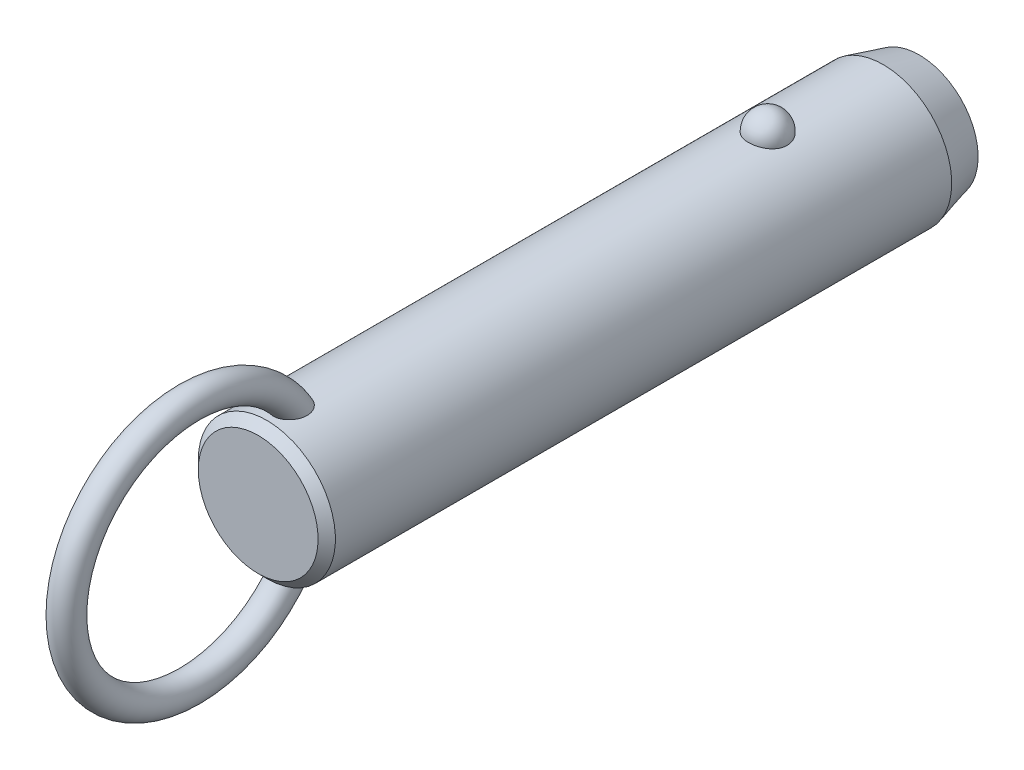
ISO-10303-21;
HEADER;
FILE_DESCRIPTION(('STEP AP214'),'2;1');
FILE_NAME('part.step','',(''),(''),'','','');
FILE_SCHEMA(('AUTOMOTIVE_DESIGN { 1 0 10303 214 1 1 1 1 }'));
ENDSEC;
DATA;
#1=APPLICATION_CONTEXT('core data for automotive mechanical design processes');
#2=APPLICATION_PROTOCOL_DEFINITION('international standard','automotive_design',2000,#1);
#3=PRODUCT_CONTEXT('',#1,'mechanical');
#4=PRODUCT('Part','Part','',(#3));
#5=PRODUCT_RELATED_PRODUCT_CATEGORY('part','',(#4));
#6=PRODUCT_DEFINITION_FORMATION('','',#4);
#7=PRODUCT_DEFINITION_CONTEXT('part definition',#1,'design');
#8=PRODUCT_DEFINITION('design','',#6,#7);
#9=PRODUCT_DEFINITION_SHAPE('','',#8);
#10=(LENGTH_UNIT() NAMED_UNIT(*) SI_UNIT(.MILLI.,.METRE.));
#11=(NAMED_UNIT(*) PLANE_ANGLE_UNIT() SI_UNIT($,.RADIAN.));
#12=(NAMED_UNIT(*) SI_UNIT($,.STERADIAN.) SOLID_ANGLE_UNIT());
#13=UNCERTAINTY_MEASURE_WITH_UNIT(LENGTH_MEASURE(1.E-05),#10,'distance_accuracy_value','');
#14=(GEOMETRIC_REPRESENTATION_CONTEXT(3) GLOBAL_UNCERTAINTY_ASSIGNED_CONTEXT((#13)) GLOBAL_UNIT_ASSIGNED_CONTEXT((#10,
#11,#12)) REPRESENTATION_CONTEXT('',''));
#15=CARTESIAN_POINT('',(0.,0.,0.));
#16=DIRECTION('',(0.,0.,1.));
#17=DIRECTION('',(1.,0.,0.));
#18=AXIS2_PLACEMENT_3D('',#15,#16,#17);
#19=CARTESIAN_POINT('',(0.,0.,58.4));
#20=DIRECTION('',(0.,0.,-1.));
#21=DIRECTION('',(-1.,0.,0.));
#22=AXIS2_PLACEMENT_3D('',#19,#20,#21);
#23=CYLINDRICAL_SURFACE('',#22,9.5);
#24=CARTESIAN_POINT('',(2.67259918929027,9.11631578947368,-2.70000000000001));
#25=CARTESIAN_POINT('',(2.6725968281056,9.11631786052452,-2.54909854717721));
#26=CARTESIAN_POINT('',(2.66030567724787,9.11994722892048,-2.39816735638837));
#27=CARTESIAN_POINT('',(2.6114347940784,9.13405924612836,-2.10058568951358));
#28=CARTESIAN_POINT('',(2.57484658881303,9.14454428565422,-1.95393672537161));
#29=CARTESIAN_POINT('',(2.47830875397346,9.17117631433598,-1.66916069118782));
#30=CARTESIAN_POINT('',(2.41836936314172,9.18732082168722,-1.53102991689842));
#31=CARTESIAN_POINT('',(2.27661331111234,9.22346780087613,-1.26705393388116));
#32=CARTESIAN_POINT('',(2.19479699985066,9.24347021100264,-1.14120852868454));
#33=CARTESIAN_POINT('',(2.01085282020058,9.28522401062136,-0.904632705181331));
#34=CARTESIAN_POINT('',(1.90862396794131,9.30698376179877,-0.793982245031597));
#35=CARTESIAN_POINT('',(1.6867437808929,9.34973971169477,-0.591607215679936));
#36=CARTESIAN_POINT('',(1.56709244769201,9.37073591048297,-0.499882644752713));
#37=CARTESIAN_POINT('',(1.31393976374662,9.40956370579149,-0.338167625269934));
#38=CARTESIAN_POINT('',(1.18048026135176,9.42740444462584,-0.268113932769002));
#39=CARTESIAN_POINT('',(0.903154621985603,9.45799906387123,-0.151390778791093));
#40=CARTESIAN_POINT('',(0.759289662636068,9.47075351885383,-0.104718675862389));
#41=CARTESIAN_POINT('',(0.468074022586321,9.48956256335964,-0.0367633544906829));
#42=CARTESIAN_POINT('',(0.320836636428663,9.49573643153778,-0.0150275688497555));
#43=CARTESIAN_POINT('',(0.0246714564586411,9.50112183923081,0.00396199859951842));
#44=CARTESIAN_POINT('',(-0.124256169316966,9.50033406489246,0.00121819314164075));
#45=CARTESIAN_POINT('',(-0.417264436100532,9.4919475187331,-0.0284441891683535));
#46=CARTESIAN_POINT('',(-0.56138413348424,9.48444885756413,-0.0550074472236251));
#47=CARTESIAN_POINT('',(-0.842986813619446,9.46357853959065,-0.131064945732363));
#48=CARTESIAN_POINT('',(-0.980469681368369,9.450206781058,-0.180559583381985));
#49=CARTESIAN_POINT('',(-1.24585005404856,9.41890822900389,-0.301476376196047));
#50=CARTESIAN_POINT('',(-1.37368611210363,9.40095498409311,-0.373026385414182));
#51=CARTESIAN_POINT('',(-1.61552738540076,9.36242964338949,-0.536025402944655));
#52=CARTESIAN_POINT('',(-1.72953116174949,9.34185727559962,-0.627476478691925));
#53=CARTESIAN_POINT('',(-1.9429225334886,9.29984568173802,-0.829844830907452));
#54=CARTESIAN_POINT('',(-2.04198021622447,9.27839736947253,-0.94110821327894));
#55=CARTESIAN_POINT('',(-2.22026460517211,9.23735994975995,-1.17883414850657));
#56=CARTESIAN_POINT('',(-2.29948985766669,9.21777097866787,-1.30529781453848));
#57=CARTESIAN_POINT('',(-2.43697287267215,9.18238994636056,-1.57158566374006));
#58=CARTESIAN_POINT('',(-2.49497068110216,9.16664569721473,-1.71155057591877));
#59=CARTESIAN_POINT('',(-2.5872073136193,9.14104303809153,-1.99961197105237));
#60=CARTESIAN_POINT('',(-2.62144683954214,9.13118445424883,-2.14770821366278));
#61=CARTESIAN_POINT('',(-2.66521466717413,9.11850622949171,-2.44715424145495));
#62=CARTESIAN_POINT('',(-2.67484831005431,9.11565658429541,-2.59848735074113));
#63=CARTESIAN_POINT('',(-2.66946735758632,9.11723375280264,-2.90067317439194));
#64=CARTESIAN_POINT('',(-2.65445345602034,9.12166036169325,-3.05152590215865));
#65=CARTESIAN_POINT('',(-2.60029711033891,9.13724422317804,-3.34766110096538));
#66=CARTESIAN_POINT('',(-2.56127978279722,9.14836656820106,-3.49296833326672));
#67=CARTESIAN_POINT('',(-2.46018844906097,9.17606676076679,-3.77477535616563));
#68=CARTESIAN_POINT('',(-2.39811349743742,9.1926448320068,-3.9112747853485));
#69=CARTESIAN_POINT('',(-2.25202303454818,9.22952198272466,-4.17244273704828));
#70=CARTESIAN_POINT('',(-2.16788714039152,9.24984129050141,-4.29704106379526));
#71=CARTESIAN_POINT('',(-1.9799408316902,9.29188255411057,-4.53013066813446));
#72=CARTESIAN_POINT('',(-1.87612963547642,9.31360456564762,-4.63862130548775));
#73=CARTESIAN_POINT('',(-1.65105429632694,9.35612959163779,-4.8369029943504));
#74=CARTESIAN_POINT('',(-1.52972405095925,9.37692871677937,-4.92661991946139));
#75=CARTESIAN_POINT('',(-1.27318250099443,9.41518970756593,-5.08429106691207));
#76=CARTESIAN_POINT('',(-1.13797219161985,9.432651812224,-5.15224684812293));
#77=CARTESIAN_POINT('',(-0.859280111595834,9.46208255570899,-5.26371827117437));
#78=CARTESIAN_POINT('',(-0.715925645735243,9.47411833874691,-5.30753421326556));
#79=CARTESIAN_POINT('',(-0.423550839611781,9.4916822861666,-5.37076321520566));
#80=CARTESIAN_POINT('',(-0.2745312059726,9.49721125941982,-5.39017930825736));
#81=CARTESIAN_POINT('',(0.0218446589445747,9.50110860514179,-5.40390587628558));
#82=CARTESIAN_POINT('',(0.16917707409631,9.49961381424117,-5.39869609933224));
#83=CARTESIAN_POINT('',(0.460808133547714,9.48993906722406,-5.36441955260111));
#84=CARTESIAN_POINT('',(0.605106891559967,9.48175936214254,-5.33535367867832));
#85=CARTESIAN_POINT('',(0.886027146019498,9.4596376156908,-5.25435587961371));
#86=CARTESIAN_POINT('',(1.02267710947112,9.44571881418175,-5.20251612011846));
#87=CARTESIAN_POINT('',(1.28523827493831,9.41358993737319,-5.07741549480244));
#88=CARTESIAN_POINT('',(1.41114877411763,9.39537958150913,-5.00415322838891));
#89=CARTESIAN_POINT('',(1.65085227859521,9.3562644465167,-4.83684599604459));
#90=CARTESIAN_POINT('',(1.76442346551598,9.33532178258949,-4.74249218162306));
#91=CARTESIAN_POINT('',(1.97425672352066,9.29321198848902,-4.53620389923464));
#92=CARTESIAN_POINT('',(2.07051582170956,9.27204482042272,-4.42426641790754));
#93=CARTESIAN_POINT('',(2.24490086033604,9.23139221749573,-4.18363183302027));
#94=CARTESIAN_POINT('',(2.32267019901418,9.21194380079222,-4.05466990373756));
#95=CARTESIAN_POINT('',(2.45584092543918,9.1773419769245,-3.78517836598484));
#96=CARTESIAN_POINT('',(2.5112497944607,9.16218713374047,-3.64465264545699));
#97=CARTESIAN_POINT('',(2.59380876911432,9.13913522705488,-3.37104301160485));
#98=CARTESIAN_POINT('',(2.62330266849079,9.13064624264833,-3.23871053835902));
#99=CARTESIAN_POINT('',(2.66269870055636,9.11923566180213,-2.97092664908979));
#100=CARTESIAN_POINT('',(2.67260130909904,9.11631393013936,-2.83547530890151));
#101=CARTESIAN_POINT('',(2.67259918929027,9.11631578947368,-2.70000000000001));
#102=B_SPLINE_CURVE_WITH_KNOTS('',3,(#24,#25,#26,#27,#28,#29,#30,#31,#32,#33,#34,#35,#36,#37,
#38,#39,#40,#41,#42,#43,#44,#45,#46,#47,#48,#49,#50,#51,#52,#53,#54,#55,#56,#57,#58,#59,#60,#61,
#62,#63,#64,#65,#66,#67,#68,#69,#70,#71,#72,#73,#74,#75,#76,#77,#78,#79,#80,#81,#82,#83,#84,#85,
#86,#87,#88,#89,#90,#91,#92,#93,#94,#95,#96,#97,#98,#99,#100,#101),.UNSPECIFIED.,.T.,.F.,(4,2,2,
2,2,2,2,2,2,2,2,2,2,2,2,2,2,2,2,2,2,2,2,2,2,2,2,2,2,2,2,2,2,2,2,2,2,2,4),(0.,0.452217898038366,
0.904593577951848,1.35677112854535,1.80894144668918,2.26340676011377,2.71787203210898,
3.17099820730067,3.62407318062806,4.0687883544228,4.51345969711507,4.95160616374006,
5.38976021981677,5.83050358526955,6.27129275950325,6.72071308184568,7.17016633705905,
7.62495278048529,8.07972578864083,8.53254856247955,8.98535859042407,9.43582813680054,
9.88631615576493,10.3393155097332,10.7923328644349,11.2471065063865,11.7018475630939,
12.150795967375,12.599688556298,13.0398725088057,13.4800399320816,13.9184421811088,
14.3568730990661,14.802202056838,15.2476074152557,15.7010097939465,16.1542603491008,
16.5602594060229,16.966248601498),.UNSPECIFIED.);
#103=CARTESIAN_POINT('',(2.67259918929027,9.11631578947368,-2.70000000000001));
#104=VERTEX_POINT('',#103);
#105=EDGE_CURVE('E41',#104,#104,#102,.T.);
#106=ORIENTED_EDGE('',*,*,#105,.T.);
#107=EDGE_LOOP('',(#106));
#108=FACE_BOUND('',#107,.T.);
#109=CARTESIAN_POINT('',(0.,0.,66.72));
#110=DIRECTION('',(0.,0.,1.));
#111=DIRECTION('',(1.,0.,0.));
#112=AXIS2_PLACEMENT_3D('',#109,#110,#111);
#113=CIRCLE('',#112,9.5);
#114=CARTESIAN_POINT('',(-9.50000000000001,0.,66.72));
#115=VERTEX_POINT('',#114);
#116=EDGE_CURVE('E10',#115,#115,#113,.F.);
#117=ORIENTED_EDGE('',*,*,#116,.T.);
#118=EDGE_LOOP('',(#117));
#119=FACE_BOUND('',#118,.T.);
#120=CARTESIAN_POINT('',(-0.697062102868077,-9.47439269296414,61.0678088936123));
#121=CARTESIAN_POINT('',(-0.799579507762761,-9.46685146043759,61.1074823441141));
#122=CARTESIAN_POINT('',(-0.898575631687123,-9.45788043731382,61.1559309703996));
#123=CARTESIAN_POINT('',(-1.08670047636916,-9.43811593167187,61.2688685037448));
#124=CARTESIAN_POINT('',(-1.17583204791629,-9.42732297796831,61.3333527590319));
#125=CARTESIAN_POINT('',(-1.34179806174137,-9.40513672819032,61.4762099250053));
#126=CARTESIAN_POINT('',(-1.41865133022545,-9.39374438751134,61.554561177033));
#127=CARTESIAN_POINT('',(-1.5586004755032,-9.37154196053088,61.7227524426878));
#128=CARTESIAN_POINT('',(-1.62169476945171,-9.3607319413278,61.8125937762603));
#129=CARTESIAN_POINT('',(-1.73527695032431,-9.34035749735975,62.0045001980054));
#130=CARTESIAN_POINT('',(-1.7852226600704,-9.33085270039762,62.1068910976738));
#131=CARTESIAN_POINT('',(-1.86924997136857,-9.3143834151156,62.318148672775));
#132=CARTESIAN_POINT('',(-1.90332570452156,-9.30741986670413,62.4270177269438));
#133=CARTESIAN_POINT('',(-1.95893603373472,-9.29588482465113,62.6604730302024));
#134=CARTESIAN_POINT('',(-1.97872420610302,-9.29165182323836,62.7854890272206));
#135=CARTESIAN_POINT('',(-2.00062129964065,-9.28695978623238,63.0370805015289));
#136=CARTESIAN_POINT('',(-2.00272284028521,-9.28650232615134,63.163656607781));
#137=CARTESIAN_POINT('',(-1.98958876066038,-9.28932750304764,63.4368157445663));
#138=CARTESIAN_POINT('',(-1.97143366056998,-9.2932400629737,63.5832519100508));
#139=CARTESIAN_POINT('',(-1.91479925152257,-9.30507151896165,63.8720629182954));
#140=CARTESIAN_POINT('',(-1.87629122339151,-9.31299607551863,64.014431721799));
#141=CARTESIAN_POINT('',(-1.77225683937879,-9.33340232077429,64.3151725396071));
#142=CARTESIAN_POINT('',(-1.70334898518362,-9.34641636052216,64.4723691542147));
#143=CARTESIAN_POINT('',(-1.58111062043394,-9.36759153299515,64.6975171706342));
#144=CARTESIAN_POINT('',(-1.53721459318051,-9.37492619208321,64.7707968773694));
#145=CARTESIAN_POINT('',(-1.4430263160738,-9.38988566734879,64.9130740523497));
#146=CARTESIAN_POINT('',(-1.39273721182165,-9.39751033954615,64.9820736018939));
#147=CARTESIAN_POINT('',(-1.26775962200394,-9.41530678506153,65.1369832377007));
#148=CARTESIAN_POINT('',(-1.19052326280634,-9.42548108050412,65.2208712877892));
#149=CARTESIAN_POINT('',(-1.0242024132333,-9.44499825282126,65.3760086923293));
#150=CARTESIAN_POINT('',(-0.935139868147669,-9.45434261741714,65.4472808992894));
#151=CARTESIAN_POINT('',(-0.76661041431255,-9.46930670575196,65.5586955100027));
#152=CARTESIAN_POINT('',(-0.689439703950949,-9.47529223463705,65.6022354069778));
#153=CARTESIAN_POINT('',(-0.528942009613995,-9.48560294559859,65.6763133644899));
#154=CARTESIAN_POINT('',(-0.445620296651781,-9.48992953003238,65.7068624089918));
#155=CARTESIAN_POINT('',(-0.273901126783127,-9.49644161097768,65.7525792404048));
#156=CARTESIAN_POINT('',(-0.185465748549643,-9.49860811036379,65.76761059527));
#157=CARTESIAN_POINT('',(-0.00734541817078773,-9.5004135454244,65.7801494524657));
#158=CARTESIAN_POINT('',(0.0823387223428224,-9.50005405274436,65.7776678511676));
#159=CARTESIAN_POINT('',(0.247679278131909,-9.49708301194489,65.7569959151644));
#160=CARTESIAN_POINT('',(0.323620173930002,-9.49477609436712,65.7409300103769));
#161=CARTESIAN_POINT('',(0.471981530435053,-9.48855917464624,65.6971726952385));
#162=CARTESIAN_POINT('',(0.544400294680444,-9.48464840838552,65.6694757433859));
#163=CARTESIAN_POINT('',(0.708947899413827,-9.47398336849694,65.5928026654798));
#164=CARTESIAN_POINT('',(0.799149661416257,-9.46671310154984,65.5397745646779));
#165=CARTESIAN_POINT('',(0.969783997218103,-9.4507622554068,65.4199731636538));
#166=CARTESIAN_POINT('',(1.05019415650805,-9.44207854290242,65.3531692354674));
#167=CARTESIAN_POINT('',(1.23092343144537,-9.42051459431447,65.1807596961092));
#168=CARTESIAN_POINT('',(1.32652499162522,-9.40733378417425,65.0702619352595));
#169=CARTESIAN_POINT('',(1.49893121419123,-9.38140745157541,64.8355614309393));
#170=CARTESIAN_POINT('',(1.57571616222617,-9.36866239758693,64.7113445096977));
#171=CARTESIAN_POINT('',(1.71285426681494,-9.34457644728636,64.4493891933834));
#172=CARTESIAN_POINT('',(1.77266365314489,-9.33328726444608,64.3113623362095));
#173=CARTESIAN_POINT('',(1.87239208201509,-9.31379209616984,64.0280515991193));
#174=CARTESIAN_POINT('',(1.91230158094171,-9.3055875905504,63.882764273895));
#175=CARTESIAN_POINT('',(1.9760418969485,-9.29228394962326,63.5620281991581));
#176=CARTESIAN_POINT('',(1.99587438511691,-9.28797202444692,63.3857248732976));
#177=CARTESIAN_POINT('',(2.0029570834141,-9.28645519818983,63.0324146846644));
#178=CARTESIAN_POINT('',(1.99025930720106,-9.28923895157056,62.8554093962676));
#179=CARTESIAN_POINT('',(1.93735479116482,-9.30038134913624,62.5563381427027));
#180=CARTESIAN_POINT('',(1.90576827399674,-9.30697680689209,62.4326679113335));
#181=CARTESIAN_POINT('',(1.82287484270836,-9.32356855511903,62.1923297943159));
#182=CARTESIAN_POINT('',(1.7715821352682,-9.33356239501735,62.0756569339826));
#183=CARTESIAN_POINT('',(1.64885744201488,-9.35602275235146,61.8527061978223));
#184=CARTESIAN_POINT('',(1.57730995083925,-9.36850332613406,61.7464927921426));
#185=CARTESIAN_POINT('',(1.41543264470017,-9.39431873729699,61.5495530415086));
#186=CARTESIAN_POINT('',(1.3251088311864,-9.40765330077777,61.4588217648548));
#187=CARTESIAN_POINT('',(1.13846223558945,-9.43195720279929,61.3050334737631));
#188=CARTESIAN_POINT('',(1.04369890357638,-9.44302894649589,61.2400947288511));
#189=CARTESIAN_POINT('',(0.843965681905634,-9.46296805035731,61.1280388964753));
#190=CARTESIAN_POINT('',(0.739000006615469,-9.4718363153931,61.0809144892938));
#191=CARTESIAN_POINT('',(0.528175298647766,-9.48586140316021,61.0081173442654));
#192=CARTESIAN_POINT('',(0.422686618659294,-9.49119633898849,60.9814024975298));
#193=CARTESIAN_POINT('',(0.208590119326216,-9.49831365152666,60.9460137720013));
#194=CARTESIAN_POINT('',(0.0999817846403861,-9.500095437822,60.9373428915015));
#195=CARTESIAN_POINT('',(-0.126104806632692,-9.49988861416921,60.9383501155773));
#196=CARTESIAN_POINT('',(-0.243578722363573,-9.49757821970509,60.9495942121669));
#197=CARTESIAN_POINT('',(-0.474390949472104,-9.48885165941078,60.993167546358));
#198=CARTESIAN_POINT('',(-0.587729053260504,-9.48243528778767,61.0254978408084));
#199=CARTESIAN_POINT('',(-0.697062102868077,-9.47439269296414,61.0678088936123));
#200=B_SPLINE_CURVE_WITH_KNOTS('',3,(#120,#121,#122,#123,#124,#125,#126,#127,#128,#129,#130,
#131,#132,#133,#134,#135,#136,#137,#138,#139,#140,#141,#142,#143,#144,#145,#146,#147,#148,#149,
#150,#151,#152,#153,#154,#155,#156,#157,#158,#159,#160,#161,#162,#163,#164,#165,#166,#167,#168,
#169,#170,#171,#172,#173,#174,#175,#176,#177,#178,#179,#180,#181,#182,#183,#184,#185,#186,#187,
#188,#189,#190,#191,#192,#193,#194,#195,#196,#197,#198,#199),.UNSPECIFIED.,.T.,.F.,(4,2,2,2,2,2,
2,2,2,2,2,2,2,2,2,2,2,2,2,2,2,2,2,2,2,2,2,2,2,2,2,2,2,2,2,2,2,2,2,4),(0.,0.330119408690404,
0.660143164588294,0.989655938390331,1.31920659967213,1.66074728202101,2.00241415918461,
2.38088696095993,2.75951768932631,3.20065679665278,3.6424200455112,4.15620996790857,
4.41314162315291,4.66994734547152,5.0122866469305,5.35399933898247,5.61943037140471,
5.88463652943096,6.15215502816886,6.41950709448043,6.65144391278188,6.88349136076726,
7.19641200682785,7.51003602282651,7.94779711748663,8.38601491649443,8.83699707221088,
9.28819530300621,9.81778662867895,10.3465317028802,10.7284172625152,11.110028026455,
11.4938603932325,11.8775702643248,12.2220189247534,12.5663259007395,12.8915939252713,
13.2169159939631,13.5689650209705,13.9210316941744),.UNSPECIFIED.);
#201=CARTESIAN_POINT('',(-0.697062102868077,-9.47439269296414,61.0678088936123));
#202=VERTEX_POINT('',#201);
#203=EDGE_CURVE('E60',#202,#202,#200,.T.);
#204=ORIENTED_EDGE('',*,*,#203,.T.);
#205=EDGE_LOOP('',(#204));
#206=FACE_BOUND('',#205,.T.);
#207=CARTESIAN_POINT('',(-0.697062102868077,9.47439269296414,61.0678088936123));
#208=CARTESIAN_POINT('',(-0.597792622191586,9.48169483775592,61.0293956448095));
#209=CARTESIAN_POINT('',(-0.495106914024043,9.48766580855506,60.9991682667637));
#210=CARTESIAN_POINT('',(-0.285876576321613,9.49627648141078,60.9560327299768));
#211=CARTESIAN_POINT('',(-0.179324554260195,9.49890941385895,60.9431597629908));
#212=CARTESIAN_POINT('',(0.0344157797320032,9.50053798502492,60.9351666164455));
#213=CARTESIAN_POINT('',(0.141603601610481,9.49953613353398,60.9400341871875));
#214=CARTESIAN_POINT('',(0.35356357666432,9.49401038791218,60.9673654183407));
#215=CARTESIAN_POINT('',(0.458336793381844,9.48948807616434,60.98982117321));
#216=CARTESIAN_POINT('',(0.662493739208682,9.4774236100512,61.0516719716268));
#217=CARTESIAN_POINT('',(0.76188104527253,9.46988348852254,61.0910556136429));
#218=CARTESIAN_POINT('',(0.952608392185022,9.45260382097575,61.1856342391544));
#219=CARTESIAN_POINT('',(1.04394806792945,9.44286417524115,61.2408299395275));
#220=CARTESIAN_POINT('',(1.21712767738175,9.4221176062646,61.3660662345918));
#221=CARTESIAN_POINT('',(1.29885671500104,9.41109835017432,61.4362579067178));
#222=CARTESIAN_POINT('',(1.44978975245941,9.38903310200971,61.588980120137));
#223=CARTESIAN_POINT('',(1.51899278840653,9.37798710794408,61.6715116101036));
#224=CARTESIAN_POINT('',(1.64602857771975,9.35654375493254,61.8497763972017));
#225=CARTESIAN_POINT('',(1.70333052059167,9.34618688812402,61.9458916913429));
#226=CARTESIAN_POINT('',(1.80259341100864,9.32755128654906,62.145897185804));
#227=CARTESIAN_POINT('',(1.84454942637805,9.31927322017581,62.2497898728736));
#228=CARTESIAN_POINT('',(1.91637039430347,9.30478365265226,62.472213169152));
#229=CARTESIAN_POINT('',(1.944805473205,9.29882552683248,62.5912192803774));
#230=CARTESIAN_POINT('',(1.98449865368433,9.29043398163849,62.8321436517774));
#231=CARTESIAN_POINT('',(1.99574908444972,9.28800213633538,62.9540631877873));
#232=CARTESIAN_POINT('',(2.00275141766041,9.28649645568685,63.2169324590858));
#233=CARTESIAN_POINT('',(1.99588238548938,9.28799035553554,63.3579529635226));
#234=CARTESIAN_POINT('',(1.96270559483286,9.29505517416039,63.6376217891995));
#235=CARTESIAN_POINT('',(1.93637872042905,9.30063010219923,63.776267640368));
#236=CARTESIAN_POINT('',(1.85949176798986,9.31633564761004,64.0725616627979));
#237=CARTESIAN_POINT('',(1.80549792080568,9.3270926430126,64.2292907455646));
#238=CARTESIAN_POINT('',(1.67376869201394,9.3516306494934,64.5322840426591));
#239=CARTESIAN_POINT('',(1.5960318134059,9.36541185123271,64.6785475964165));
#240=CARTESIAN_POINT('',(1.4360277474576,9.39110706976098,64.9258138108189));
#241=CARTESIAN_POINT('',(1.35831795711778,9.40278656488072,65.029791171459));
#242=CARTESIAN_POINT('',(1.18774483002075,9.42585025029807,65.2245347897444));
#243=CARTESIAN_POINT('',(1.09490932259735,9.43723493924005,65.3153247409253));
#244=CARTESIAN_POINT('',(0.921110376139,9.45552616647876,65.4562033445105));
#245=CARTESIAN_POINT('',(0.843738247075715,9.46281058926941,65.5106563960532));
#246=CARTESIAN_POINT('',(0.681245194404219,9.47589120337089,65.6067117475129));
#247=CARTESIAN_POINT('',(0.596135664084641,9.48168953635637,65.6483325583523));
#248=CARTESIAN_POINT('',(0.433779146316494,9.49038144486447,65.7100899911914));
#249=CARTESIAN_POINT('',(0.357459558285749,9.49359170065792,65.7326013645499));
#250=CARTESIAN_POINT('',(0.202074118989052,9.49816761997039,65.7645745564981));
#251=CARTESIAN_POINT('',(0.123010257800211,9.49953459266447,65.7740456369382));
#252=CARTESIAN_POINT('',(-0.0357372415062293,9.50026497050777,65.7791143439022));
#253=CARTESIAN_POINT('',(-0.115421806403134,9.49962433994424,65.7746840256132));
#254=CARTESIAN_POINT('',(-0.272823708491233,9.49640854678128,65.7522962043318));
#255=CARTESIAN_POINT('',(-0.350540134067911,9.4938325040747,65.7343325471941));
#256=CARTESIAN_POINT('',(-0.500580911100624,9.4870946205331,65.6868028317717));
#257=CARTESIAN_POINT('',(-0.572979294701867,9.48296359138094,65.6574618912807));
#258=CARTESIAN_POINT('',(-0.712864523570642,9.47347609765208,65.5890087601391));
#259=CARTESIAN_POINT('',(-0.780349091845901,9.46811906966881,65.5498920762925));
#260=CARTESIAN_POINT('',(-0.946309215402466,9.45329720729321,65.439432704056));
#261=CARTESIAN_POINT('',(-1.04090230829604,9.44321512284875,65.3623297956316));
#262=CARTESIAN_POINT('',(-1.21661929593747,9.42219227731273,65.1940971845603));
#263=CARTESIAN_POINT('',(-1.29770519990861,9.41124921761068,65.1029292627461));
#264=CARTESIAN_POINT('',(-1.47319646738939,9.38563439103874,64.8761621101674));
#265=CARTESIAN_POINT('',(-1.5620887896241,9.37102009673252,64.7362895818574));
#266=CARTESIAN_POINT('',(-1.71623987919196,9.34401559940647,64.4439503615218));
#267=CARTESIAN_POINT('',(-1.78147866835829,9.33162728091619,64.2914731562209));
#268=CARTESIAN_POINT('',(-1.88853837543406,9.31055541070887,63.9756470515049));
#269=CARTESIAN_POINT('',(-1.92998995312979,9.30193076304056,63.8121685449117));
#270=CARTESIAN_POINT('',(-1.98590726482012,9.29015757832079,63.4805268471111));
#271=CARTESIAN_POINT('',(-2.0004070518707,9.2870021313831,63.3123698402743));
#272=CARTESIAN_POINT('',(-1.99964701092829,9.28716218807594,63.0050806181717));
#273=CARTESIAN_POINT('',(-1.98908145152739,9.28945704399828,62.8659362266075));
#274=CARTESIAN_POINT('',(-1.94566294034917,9.29865169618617,62.5911539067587));
#275=CARTESIAN_POINT('',(-1.9128206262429,9.30554929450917,62.455514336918));
#276=CARTESIAN_POINT('',(-1.84582133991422,9.31898248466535,62.2578026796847));
#277=CARTESIAN_POINT('',(-1.82038084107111,9.32400364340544,62.192583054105));
#278=CARTESIAN_POINT('',(-1.7635051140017,9.33492884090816,62.0649033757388));
#279=CARTESIAN_POINT('',(-1.73207305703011,9.34083241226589,62.0024418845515));
#280=CARTESIAN_POINT('',(-1.6632424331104,9.353333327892,61.8809407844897));
#281=CARTESIAN_POINT('',(-1.62584239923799,9.35993084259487,61.8219020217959));
#282=CARTESIAN_POINT('',(-1.54527678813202,9.37356864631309,61.7079875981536));
#283=CARTESIAN_POINT('',(-1.50211241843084,9.38060884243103,61.6531110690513));
#284=CARTESIAN_POINT('',(-1.37681147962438,9.40004442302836,61.5099619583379));
#285=CARTESIAN_POINT('',(-1.28916358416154,9.41261047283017,61.4264295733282));
#286=CARTESIAN_POINT('',(-1.09996826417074,9.43658180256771,61.2772360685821));
#287=CARTESIAN_POINT('',(-0.998461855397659,9.44799034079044,61.2115238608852));
#288=CARTESIAN_POINT('',(-0.860188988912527,9.46103017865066,61.1394367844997));
#289=CARTESIAN_POINT('',(-0.828141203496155,9.46389141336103,61.1238511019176));
#290=CARTESIAN_POINT('',(-0.763210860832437,9.46934915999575,61.0944734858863));
#291=CARTESIAN_POINT('',(-0.730328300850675,9.47194567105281,61.0806815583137));
#292=CARTESIAN_POINT('',(-0.697062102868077,9.47439269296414,61.0678088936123));
#293=B_SPLINE_CURVE_WITH_KNOTS('',3,(#207,#208,#209,#210,#211,#212,#213,#214,#215,#216,#217,
#218,#219,#220,#221,#222,#223,#224,#225,#226,#227,#228,#229,#230,#231,#232,#233,#234,#235,#236,
#237,#238,#239,#240,#241,#242,#243,#244,#245,#246,#247,#248,#249,#250,#251,#252,#253,#254,#255,
#256,#257,#258,#259,#260,#261,#262,#263,#264,#265,#266,#267,#268,#269,#270,#271,#272,#273,#274,
#275,#276,#277,#278,#279,#280,#281,#282,#283,#284,#285,#286,#287,#288,#289,#290,#291,#292),
.UNSPECIFIED.,.T.,.F.,(4,2,2,2,2,2,2,2,2,2,2,2,2,2,2,2,2,2,2,2,2,2,2,2,2,2,2,2,2,2,2,2,2,2,2,2,
2,2,2,2,2,2,4),(0.,0.319942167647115,0.640532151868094,0.960900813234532,1.28112555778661,
1.60113495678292,1.92115886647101,2.24457323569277,2.56801248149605,2.90371927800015,
3.23953387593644,3.60560313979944,3.97183576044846,4.39383693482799,4.81625324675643,
5.31257045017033,5.80891895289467,6.19868344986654,6.58773876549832,6.87145417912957,
7.15475838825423,7.39263751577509,7.63034760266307,7.86853584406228,8.10683246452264,
8.34063661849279,8.57454843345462,8.93983939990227,9.30614105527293,9.80266668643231,
10.2996107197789,10.8040753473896,11.3079021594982,11.7249776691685,12.1418541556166,
12.3521485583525,12.5623319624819,12.7725671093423,12.9827582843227,13.345827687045,
13.7078449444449,13.8150604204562,13.9222762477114),.UNSPECIFIED.);
#294=CARTESIAN_POINT('',(-0.697062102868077,9.47439269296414,61.0678088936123));
#295=VERTEX_POINT('',#294);
#296=EDGE_CURVE('E68',#295,#295,#293,.T.);
#297=ORIENTED_EDGE('',*,*,#296,.T.);
#298=EDGE_LOOP('',(#297));
#299=FACE_BOUND('',#298,.T.);
#300=CARTESIAN_POINT('',(0.,0.,-18.6999999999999));
#301=DIRECTION('',(0.,0.,-1.));
#302=DIRECTION('',(-1.,0.,0.));
#303=AXIS2_PLACEMENT_3D('',#300,#301,#302);
#304=CIRCLE('',#303,9.5);
#305=CARTESIAN_POINT('',(-9.5,0.,-18.6999999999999));
#306=VERTEX_POINT('',#305);
#307=EDGE_CURVE('E57',#306,#306,#304,.F.);
#308=ORIENTED_EDGE('',*,*,#307,.T.);
#309=EDGE_LOOP('',(#308));
#310=FACE_BOUND('',#309,.T.);
#311=ADVANCED_FACE('F37',(#108,#119,#206,#299,#310),#23,.T.);
#312=CARTESIAN_POINT('',(0.,0.,-23.7));
#313=DIRECTION('',(0.,0.,-1.));
#314=DIRECTION('',(-1.,0.,0.));
#315=AXIS2_PLACEMENT_3D('',#312,#313,#314);
#316=PLANE('',#315);
#317=CARTESIAN_POINT('',(0.,0.,-23.7));
#318=DIRECTION('',(0.,0.,-1.));
#319=DIRECTION('',(-1.,0.,0.));
#320=AXIS2_PLACEMENT_3D('',#317,#318,#319);
#321=CIRCLE('',#320,8.16025403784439);
#322=CARTESIAN_POINT('',(-8.16025403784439,0.,-23.7));
#323=VERTEX_POINT('',#322);
#324=EDGE_CURVE('E67',#323,#323,#321,.T.);
#325=ORIENTED_EDGE('',*,*,#324,.T.);
#326=EDGE_LOOP('',(#325));
#327=FACE_BOUND('',#326,.T.);
#328=ADVANCED_FACE('F86',(#327),#316,.T.);
#329=CARTESIAN_POINT('',(0.,0.,-23.7));
#330=DIRECTION('',(0.,0.,1.));
#331=DIRECTION('',(1.,0.,0.));
#332=AXIS2_PLACEMENT_3D('',#329,#330,#331);
#333=CONICAL_SURFACE('',#332,8.16025403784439,0.261799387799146);
#334=ORIENTED_EDGE('',*,*,#307,.F.);
#335=EDGE_LOOP('',(#334));
#336=FACE_BOUND('',#335,.T.);
#337=ORIENTED_EDGE('',*,*,#324,.F.);
#338=EDGE_LOOP('',(#337));
#339=FACE_BOUND('',#338,.T.);
#340=ADVANCED_FACE('F84',(#336,#339),#333,.T.);
#341=CARTESIAN_POINT('',(0.,0.,67.92));
#342=DIRECTION('',(0.,0.,1.));
#343=DIRECTION('',(1.,0.,0.));
#344=AXIS2_PLACEMENT_3D('',#341,#342,#343);
#345=PLANE('',#344);
#346=CARTESIAN_POINT('',(0.,0.,67.92));
#347=DIRECTION('',(0.,0.,1.));
#348=DIRECTION('',(1.,0.,0.));
#349=AXIS2_PLACEMENT_3D('',#346,#347,#348);
#350=CIRCLE('',#349,8.29999999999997);
#351=CARTESIAN_POINT('',(-8.29999999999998,0.,67.92));
#352=VERTEX_POINT('',#351);
#353=EDGE_CURVE('E50',#352,#352,#350,.T.);
#354=ORIENTED_EDGE('',*,*,#353,.T.);
#355=EDGE_LOOP('',(#354));
#356=FACE_BOUND('',#355,.T.);
#357=ADVANCED_FACE('F78',(#356),#345,.T.);
#358=CARTESIAN_POINT('',(0.,0.,77.45));
#359=DIRECTION('',(1.,0.,0.));
#360=DIRECTION('',(0.,0.,-1.));
#361=AXIS2_PLACEMENT_3D('',#358,#359,#360);
#362=TOROIDAL_SURFACE('',#361,17.05,2.);
#363=ORIENTED_EDGE('',*,*,#296,.F.);
#364=EDGE_LOOP('',(#363));
#365=FACE_BOUND('',#364,.T.);
#366=ORIENTED_EDGE('',*,*,#203,.F.);
#367=EDGE_LOOP('',(#366));
#368=FACE_BOUND('',#367,.T.);
#369=ADVANCED_FACE('F74',(#365,#368),#362,.T.);
#370=CARTESIAN_POINT('',(0.,0.,67.92));
#371=DIRECTION('',(0.,0.,-1.));
#372=DIRECTION('',(-1.,0.,0.));
#373=AXIS2_PLACEMENT_3D('',#370,#371,#372);
#374=CONICAL_SURFACE('',#373,8.29999999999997,0.78539816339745);
#375=CARTESIAN_POINT('',(-9.50000000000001,0.,66.72));
#376=CARTESIAN_POINT('',(-9.48750000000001,0.,66.7325));
#377=CARTESIAN_POINT('',(-9.47500000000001,0.,66.745));
#378=CARTESIAN_POINT('',(-9.45,0.,66.77));
#379=CARTESIAN_POINT('',(-9.43750000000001,0.,66.7825));
#380=CARTESIAN_POINT('',(-9.41250000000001,0.,66.8075));
#381=CARTESIAN_POINT('',(-9.40000000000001,0.,66.82));
#382=CARTESIAN_POINT('',(-9.37500000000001,0.,66.845));
#383=CARTESIAN_POINT('',(-9.3625,0.,66.8575));
#384=CARTESIAN_POINT('',(-9.3375,0.,66.8825));
#385=CARTESIAN_POINT('',(-9.325,0.,66.895));
#386=CARTESIAN_POINT('',(-9.3,0.,66.92));
#387=CARTESIAN_POINT('',(-9.2875,0.,66.9325));
#388=CARTESIAN_POINT('',(-9.2625,0.,66.9575));
#389=CARTESIAN_POINT('',(-9.25,0.,66.97));
#390=CARTESIAN_POINT('',(-9.225,0.,66.995));
#391=CARTESIAN_POINT('',(-9.2125,0.,67.0075));
#392=CARTESIAN_POINT('',(-9.1875,0.,67.0325));
#393=CARTESIAN_POINT('',(-9.175,0.,67.045));
#394=CARTESIAN_POINT('',(-9.15,0.,67.07));
#395=CARTESIAN_POINT('',(-9.1375,0.,67.0825));
#396=CARTESIAN_POINT('',(-9.1125,0.,67.1075));
#397=CARTESIAN_POINT('',(-9.1,0.,67.12));
#398=CARTESIAN_POINT('',(-9.075,0.,67.145));
#399=CARTESIAN_POINT('',(-9.0625,0.,67.1575));
#400=CARTESIAN_POINT('',(-9.0375,0.,67.1825));
#401=CARTESIAN_POINT('',(-9.025,0.,67.195));
#402=CARTESIAN_POINT('',(-9.,0.,67.22));
#403=CARTESIAN_POINT('',(-8.98749999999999,0.,67.2325));
#404=CARTESIAN_POINT('',(-8.9625,0.,67.2575));
#405=CARTESIAN_POINT('',(-8.94999999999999,0.,67.27));
#406=CARTESIAN_POINT('',(-8.925,0.,67.295));
#407=CARTESIAN_POINT('',(-8.91249999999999,0.,67.3075));
#408=CARTESIAN_POINT('',(-8.88749999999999,0.,67.3325));
#409=CARTESIAN_POINT('',(-8.87499999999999,0.,67.345));
#410=CARTESIAN_POINT('',(-8.84999999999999,0.,67.37));
#411=CARTESIAN_POINT('',(-8.83749999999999,0.,67.3825));
#412=CARTESIAN_POINT('',(-8.81249999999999,0.,67.4075));
#413=CARTESIAN_POINT('',(-8.79999999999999,0.,67.42));
#414=CARTESIAN_POINT('',(-8.77499999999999,0.,67.445));
#415=CARTESIAN_POINT('',(-8.76249999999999,0.,67.4575));
#416=CARTESIAN_POINT('',(-8.73749999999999,0.,67.4825));
#417=CARTESIAN_POINT('',(-8.72499999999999,0.,67.495));
#418=CARTESIAN_POINT('',(-8.69999999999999,0.,67.52));
#419=CARTESIAN_POINT('',(-8.68749999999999,0.,67.5325));
#420=CARTESIAN_POINT('',(-8.66249999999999,0.,67.5575));
#421=CARTESIAN_POINT('',(-8.64999999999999,0.,67.57));
#422=CARTESIAN_POINT('',(-8.62499999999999,0.,67.595));
#423=CARTESIAN_POINT('',(-8.61249999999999,0.,67.6075));
#424=CARTESIAN_POINT('',(-8.58749999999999,0.,67.6325));
#425=CARTESIAN_POINT('',(-8.57499999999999,0.,67.645));
#426=CARTESIAN_POINT('',(-8.54999999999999,0.,67.67));
#427=CARTESIAN_POINT('',(-8.53749999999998,0.,67.6825));
#428=CARTESIAN_POINT('',(-8.51249999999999,0.,67.7075));
#429=CARTESIAN_POINT('',(-8.49999999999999,0.,67.72));
#430=CARTESIAN_POINT('',(-8.47499999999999,0.,67.745));
#431=CARTESIAN_POINT('',(-8.46249999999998,0.,67.7575));
#432=CARTESIAN_POINT('',(-8.43749999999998,0.,67.7825));
#433=CARTESIAN_POINT('',(-8.42499999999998,0.,67.795));
#434=CARTESIAN_POINT('',(-8.39999999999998,0.,67.82));
#435=CARTESIAN_POINT('',(-8.38749999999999,0.,67.8325));
#436=CARTESIAN_POINT('',(-8.36249999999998,0.,67.8575));
#437=CARTESIAN_POINT('',(-8.34999999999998,0.,67.87));
#438=CARTESIAN_POINT('',(-8.32499999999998,0.,67.895));
#439=CARTESIAN_POINT('',(-8.31249999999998,0.,67.9075));
#440=CARTESIAN_POINT('',(-8.29999999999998,0.,67.92));
#441=B_SPLINE_CURVE_WITH_KNOTS('',3,(#375,#376,#377,#378,#379,#380,#381,#382,#383,#384,#385,
#386,#387,#388,#389,#390,#391,#392,#393,#394,#395,#396,#397,#398,#399,#400,#401,#402,#403,#404,
#405,#406,#407,#408,#409,#410,#411,#412,#413,#414,#415,#416,#417,#418,#419,#420,#421,#422,#423,
#424,#425,#426,#427,#428,#429,#430,#431,#432,#433,#434,#435,#436,#437,#438,#439,#440),
.UNSPECIFIED.,.F.,.F.,(4,2,2,2,2,2,2,2,2,2,2,2,2,2,2,2,2,2,2,2,2,2,2,2,2,2,2,2,2,2,2,2,4),(0.,
0.0530330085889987,0.106066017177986,0.159099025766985,0.212132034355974,0.265165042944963,
0.318198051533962,0.371231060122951,0.42426406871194,0.477297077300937,0.530330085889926,
0.583363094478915,0.636396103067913,0.689429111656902,0.742462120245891,0.79549512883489,
0.848528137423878,0.901561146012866,0.954594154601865,1.00762716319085,1.06066017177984,
1.11369318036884,1.16672618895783,1.21975919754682,1.27279220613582,1.32582521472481,
1.3788582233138,1.43189123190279,1.48492424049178,1.53795724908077,1.59099025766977,
1.64402326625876,1.69705627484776),.UNSPECIFIED.);
#442=EDGE_CURVE('BSEAM39',#115,#352,#441,.T.);
#443=ORIENTED_EDGE('',*,*,#116,.F.);
#444=ORIENTED_EDGE('',*,*,#353,.F.);
#445=ORIENTED_EDGE('',*,*,#442,.T.);
#446=ORIENTED_EDGE('',*,*,#442,.F.);
#447=EDGE_LOOP('',(#443,#445,#444,#446));
#448=FACE_BOUND('',#447,.T.);
#449=ADVANCED_FACE('F39',(#448),#374,.T.);
#450=CARTESIAN_POINT('',(0.,9.5,-2.70000000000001));
#451=DIRECTION('',(0.,1.,0.));
#452=DIRECTION('',(0.,0.,-1.));
#453=AXIS2_PLACEMENT_3D('',#450,#451,#452);
#454=SPHERICAL_SURFACE('',#453,2.7);
#455=ORIENTED_EDGE('',*,*,#105,.F.);
#456=EDGE_LOOP('',(#455));
#457=FACE_BOUND('',#456,.T.);
#458=ADVANCED_FACE('F80',(#457),#454,.T.);
#459=CLOSED_SHELL('',(#311,#328,#340,#357,#369,#449,#458));
#460=MANIFOLD_SOLID_BREP('B2',#459);
#461=ADVANCED_BREP_SHAPE_REPRESENTATION('',(#18,#460),#14);
#462=SHAPE_DEFINITION_REPRESENTATION(#9,#461);
ENDSEC;
END-ISO-10303-21;
